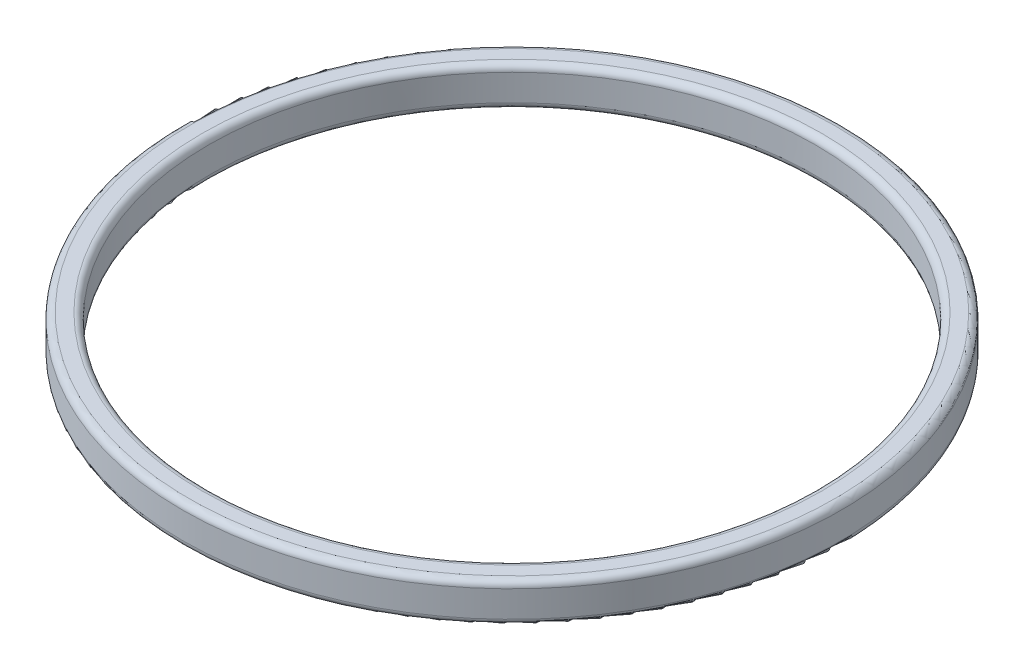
ISO-10303-21;
HEADER;
FILE_DESCRIPTION(('STEP AP214'),'2;1');
FILE_NAME('part.step','',(''),(''),'','','');
FILE_SCHEMA(('AUTOMOTIVE_DESIGN { 1 0 10303 214 1 1 1 1 }'));
ENDSEC;
DATA;
#1=APPLICATION_CONTEXT('core data for automotive mechanical design processes');
#2=APPLICATION_PROTOCOL_DEFINITION('international standard','automotive_design',2000,#1);
#3=PRODUCT_CONTEXT('',#1,'mechanical');
#4=PRODUCT('Part','Part','',(#3));
#5=PRODUCT_RELATED_PRODUCT_CATEGORY('part','',(#4));
#6=PRODUCT_DEFINITION_FORMATION('','',#4);
#7=PRODUCT_DEFINITION_CONTEXT('part definition',#1,'design');
#8=PRODUCT_DEFINITION('design','',#6,#7);
#9=PRODUCT_DEFINITION_SHAPE('','',#8);
#10=(LENGTH_UNIT() NAMED_UNIT(*) SI_UNIT(.MILLI.,.METRE.));
#11=(NAMED_UNIT(*) PLANE_ANGLE_UNIT() SI_UNIT($,.RADIAN.));
#12=(NAMED_UNIT(*) SI_UNIT($,.STERADIAN.) SOLID_ANGLE_UNIT());
#13=UNCERTAINTY_MEASURE_WITH_UNIT(LENGTH_MEASURE(1.E-05),#10,'distance_accuracy_value','');
#14=(GEOMETRIC_REPRESENTATION_CONTEXT(3) GLOBAL_UNCERTAINTY_ASSIGNED_CONTEXT((#13)) GLOBAL_UNIT_ASSIGNED_CONTEXT((#10,
#11,#12)) REPRESENTATION_CONTEXT('',''));
#15=CARTESIAN_POINT('',(0.,0.,0.));
#16=DIRECTION('',(0.,0.,1.));
#17=DIRECTION('',(1.,0.,0.));
#18=AXIS2_PLACEMENT_3D('',#15,#16,#17);
#19=CARTESIAN_POINT('',(0.,20.,0.));
#20=DIRECTION('',(0.,1.,0.));
#21=DIRECTION('',(0.,0.,1.));
#22=AXIS2_PLACEMENT_3D('',#19,#20,#21);
#23=CYLINDRICAL_SURFACE('',#22,11.5);
#24=CARTESIAN_POINT('',(0.,1.25,0.));
#25=DIRECTION('',(0.,-1.,0.));
#26=DIRECTION('',(0.,0.,-1.));
#27=AXIS2_PLACEMENT_3D('',#24,#25,#26);
#28=CIRCLE('',#27,11.5);
#29=CARTESIAN_POINT('',(0.,1.25,-11.5));
#30=VERTEX_POINT('',#29);
#31=EDGE_CURVE('E56',#30,#30,#28,.F.);
#32=ORIENTED_EDGE('',*,*,#31,.T.);
#33=EDGE_LOOP('',(#32));
#34=FACE_BOUND('',#33,.T.);
#35=CARTESIAN_POINT('',(0.,0.25,0.));
#36=DIRECTION('',(0.,1.,0.));
#37=DIRECTION('',(0.,0.,1.));
#38=AXIS2_PLACEMENT_3D('',#35,#36,#37);
#39=CIRCLE('',#38,11.5);
#40=CARTESIAN_POINT('',(0.,0.249999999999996,11.5));
#41=VERTEX_POINT('',#40);
#42=EDGE_CURVE('E59',#41,#41,#39,.F.);
#43=ORIENTED_EDGE('',*,*,#42,.T.);
#44=EDGE_LOOP('',(#43));
#45=FACE_BOUND('',#44,.T.);
#46=ADVANCED_FACE('F31',(#34,#45),#23,.F.);
#47=CARTESIAN_POINT('',(11.5,1.49999999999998,0.));
#48=DIRECTION('',(0.,-1.,0.));
#49=DIRECTION('',(0.,0.,-1.));
#50=AXIS2_PLACEMENT_3D('',#47,#48,#49);
#51=PLANE('',#50);
#52=CARTESIAN_POINT('',(0.,1.5,0.));
#53=DIRECTION('',(0.,-1.,0.));
#54=DIRECTION('',(0.,0.,-1.));
#55=AXIS2_PLACEMENT_3D('',#52,#53,#54);
#56=CIRCLE('',#55,11.75);
#57=CARTESIAN_POINT('',(0.,1.5,-11.75));
#58=VERTEX_POINT('',#57);
#59=EDGE_CURVE('E50',#58,#58,#56,.T.);
#60=ORIENTED_EDGE('',*,*,#59,.T.);
#61=EDGE_LOOP('',(#60));
#62=FACE_BOUND('',#61,.T.);
#63=CARTESIAN_POINT('',(0.,1.5,0.));
#64=DIRECTION('',(0.,-1.,0.));
#65=DIRECTION('',(0.,0.,-1.));
#66=AXIS2_PLACEMENT_3D('',#63,#64,#65);
#67=CIRCLE('',#66,12.25);
#68=CARTESIAN_POINT('',(0.,1.5,-12.25));
#69=VERTEX_POINT('',#68);
#70=EDGE_CURVE('E53',#69,#69,#67,.F.);
#71=ORIENTED_EDGE('',*,*,#70,.T.);
#72=EDGE_LOOP('',(#71));
#73=FACE_BOUND('',#72,.T.);
#74=ADVANCED_FACE('F80',(#62,#73),#51,.F.);
#75=CARTESIAN_POINT('',(0.,20.,0.));
#76=DIRECTION('',(0.,1.,0.));
#77=DIRECTION('',(0.,0.,1.));
#78=AXIS2_PLACEMENT_3D('',#75,#76,#77);
#79=CYLINDRICAL_SURFACE('',#78,12.5);
#80=CARTESIAN_POINT('',(0.,1.25,0.));
#81=DIRECTION('',(0.,-1.,0.));
#82=DIRECTION('',(0.,0.,-1.));
#83=AXIS2_PLACEMENT_3D('',#80,#81,#82);
#84=CIRCLE('',#83,12.5);
#85=CARTESIAN_POINT('',(0.,1.25,-12.5));
#86=VERTEX_POINT('',#85);
#87=EDGE_CURVE('E41',#86,#86,#84,.T.);
#88=ORIENTED_EDGE('',*,*,#87,.T.);
#89=EDGE_LOOP('',(#88));
#90=FACE_BOUND('',#89,.T.);
#91=CARTESIAN_POINT('',(0.,0.25,0.));
#92=DIRECTION('',(0.,1.,0.));
#93=DIRECTION('',(0.,0.,1.));
#94=AXIS2_PLACEMENT_3D('',#91,#92,#93);
#95=CIRCLE('',#94,12.5);
#96=CARTESIAN_POINT('',(0.,0.249999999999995,12.5));
#97=VERTEX_POINT('',#96);
#98=EDGE_CURVE('E45',#97,#97,#95,.T.);
#99=ORIENTED_EDGE('',*,*,#98,.T.);
#100=EDGE_LOOP('',(#99));
#101=FACE_BOUND('',#100,.T.);
#102=ADVANCED_FACE('F85',(#90,#101),#79,.T.);
#103=CARTESIAN_POINT('',(11.5,0.,0.));
#104=DIRECTION('',(0.,1.,0.));
#105=DIRECTION('',(0.,0.,1.));
#106=AXIS2_PLACEMENT_3D('',#103,#104,#105);
#107=PLANE('',#106);
#108=CARTESIAN_POINT('',(0.,0.,0.));
#109=DIRECTION('',(0.,1.,0.));
#110=DIRECTION('',(0.,0.,1.));
#111=AXIS2_PLACEMENT_3D('',#108,#109,#110);
#112=CIRCLE('',#111,11.75);
#113=CARTESIAN_POINT('',(0.,0.,11.75));
#114=VERTEX_POINT('',#113);
#115=EDGE_CURVE('E10',#114,#114,#112,.T.);
#116=ORIENTED_EDGE('',*,*,#115,.T.);
#117=EDGE_LOOP('',(#116));
#118=FACE_BOUND('',#117,.T.);
#119=CARTESIAN_POINT('',(0.,0.,0.));
#120=DIRECTION('',(0.,1.,0.));
#121=DIRECTION('',(0.,0.,1.));
#122=AXIS2_PLACEMENT_3D('',#119,#120,#121);
#123=CIRCLE('',#122,12.25);
#124=CARTESIAN_POINT('',(0.,0.,12.25));
#125=VERTEX_POINT('',#124);
#126=EDGE_CURVE('E37',#125,#125,#123,.F.);
#127=ORIENTED_EDGE('',*,*,#126,.T.);
#128=EDGE_LOOP('',(#127));
#129=FACE_BOUND('',#128,.T.);
#130=ADVANCED_FACE('F90',(#118,#129),#107,.F.);
#131=CARTESIAN_POINT('',(0.,1.25,0.));
#132=DIRECTION('',(0.,-1.,0.));
#133=DIRECTION('',(0.,0.,-1.));
#134=AXIS2_PLACEMENT_3D('',#131,#132,#133);
#135=TOROIDAL_SURFACE('',#134,11.75,0.25);
#136=ORIENTED_EDGE('',*,*,#59,.F.);
#137=EDGE_LOOP('',(#136));
#138=FACE_BOUND('',#137,.T.);
#139=ORIENTED_EDGE('',*,*,#31,.F.);
#140=EDGE_LOOP('',(#139));
#141=FACE_BOUND('',#140,.T.);
#142=ADVANCED_FACE('F76',(#138,#141),#135,.T.);
#143=CARTESIAN_POINT('',(0.,1.25,0.));
#144=DIRECTION('',(0.,-1.,0.));
#145=DIRECTION('',(0.,0.,-1.));
#146=AXIS2_PLACEMENT_3D('',#143,#144,#145);
#147=TOROIDAL_SURFACE('',#146,12.25,0.25);
#148=ORIENTED_EDGE('',*,*,#87,.F.);
#149=EDGE_LOOP('',(#148));
#150=FACE_BOUND('',#149,.T.);
#151=ORIENTED_EDGE('',*,*,#70,.F.);
#152=EDGE_LOOP('',(#151));
#153=FACE_BOUND('',#152,.T.);
#154=ADVANCED_FACE('F68',(#150,#153),#147,.T.);
#155=CARTESIAN_POINT('',(0.,0.25,0.));
#156=DIRECTION('',(0.,1.,0.));
#157=DIRECTION('',(0.,0.,1.));
#158=AXIS2_PLACEMENT_3D('',#155,#156,#157);
#159=TOROIDAL_SURFACE('',#158,11.75,0.25);
#160=ORIENTED_EDGE('',*,*,#42,.F.);
#161=EDGE_LOOP('',(#160));
#162=FACE_BOUND('',#161,.T.);
#163=ORIENTED_EDGE('',*,*,#115,.F.);
#164=EDGE_LOOP('',(#163));
#165=FACE_BOUND('',#164,.T.);
#166=ADVANCED_FACE('F64',(#162,#165),#159,.T.);
#167=CARTESIAN_POINT('',(0.,0.25,0.));
#168=DIRECTION('',(0.,1.,0.));
#169=DIRECTION('',(0.,0.,1.));
#170=AXIS2_PLACEMENT_3D('',#167,#168,#169);
#171=TOROIDAL_SURFACE('',#170,12.25,0.25);
#172=ORIENTED_EDGE('',*,*,#126,.F.);
#173=EDGE_LOOP('',(#172));
#174=FACE_BOUND('',#173,.T.);
#175=ORIENTED_EDGE('',*,*,#98,.F.);
#176=EDGE_LOOP('',(#175));
#177=FACE_BOUND('',#176,.T.);
#178=ADVANCED_FACE('F67',(#174,#177),#171,.T.);
#179=CLOSED_SHELL('',(#46,#74,#102,#130,#142,#154,#166,#178));
#180=MANIFOLD_SOLID_BREP('B2',#179);
#181=ADVANCED_BREP_SHAPE_REPRESENTATION('',(#18,#180),#14);
#182=SHAPE_DEFINITION_REPRESENTATION(#9,#181);
ENDSEC;
END-ISO-10303-21;
